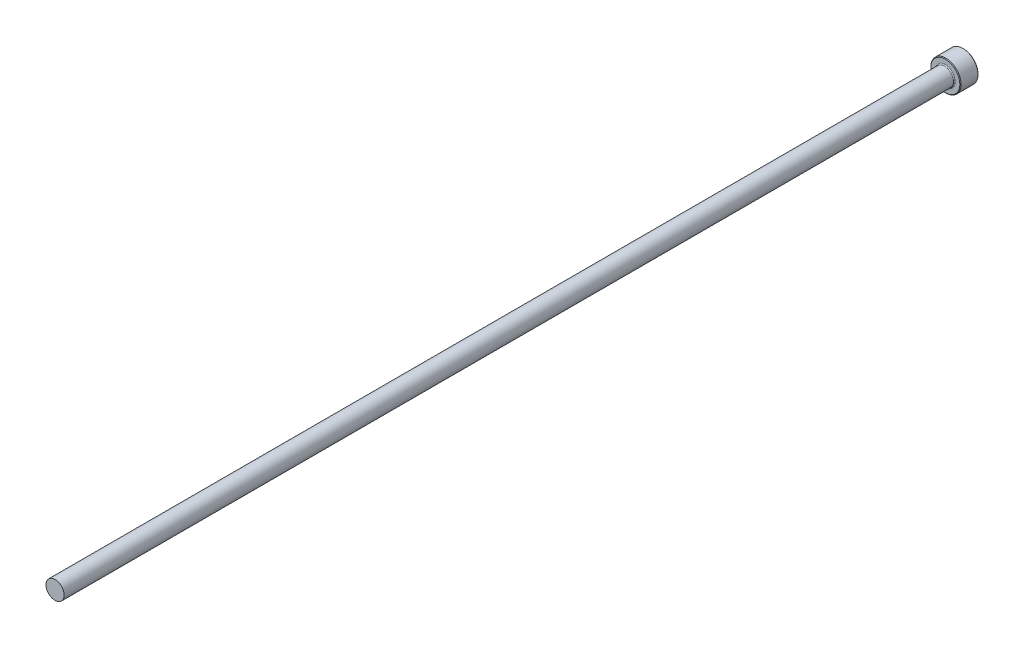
from build123d import *

# Parameters (mm, degrees)
CHAMFER1_SIZE = 0.2


with BuildPart() as part:
    # Sketch1 → Revolve1 (revolve)
    with BuildSketch(Plane(origin=(0, 0, 0), x_dir=(0, 0, -1), z_dir=(1, 0, 0)), mode=Mode.PRIVATE) as revolve1_sk:
        with BuildLine():
            Line((0, 0), (0, 5))
            Line((0, 5), (-6, 5))
            Line((-6, 5), (-6, 3.3))
            ThreePointArc((-6, 3.3), (-6.087867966, 3.087867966), (-6.3, 3))
            Line((-6.3, 3), (-300, 3))
            Line((-300, 3), (-300, 0))
            Line((-300, 0), (0, 0))
        make_face()
    revolve(revolve1_sk.sketch.rotate(Axis((0, 0, 109.05062828), (0, 0, -1)), 90), axis=Axis((0, 0, 109.05062828), (0, 0, -1)))

    # Chamfer1
    chamfer1_edges = [part.edges().sort_by_distance(p)[0] for p in [
        (-5, 0, 0),
        (-5, 0, 6),
    ]]
    chamfer(chamfer1_edges, length=CHAMFER1_SIZE)


solid = part.part
